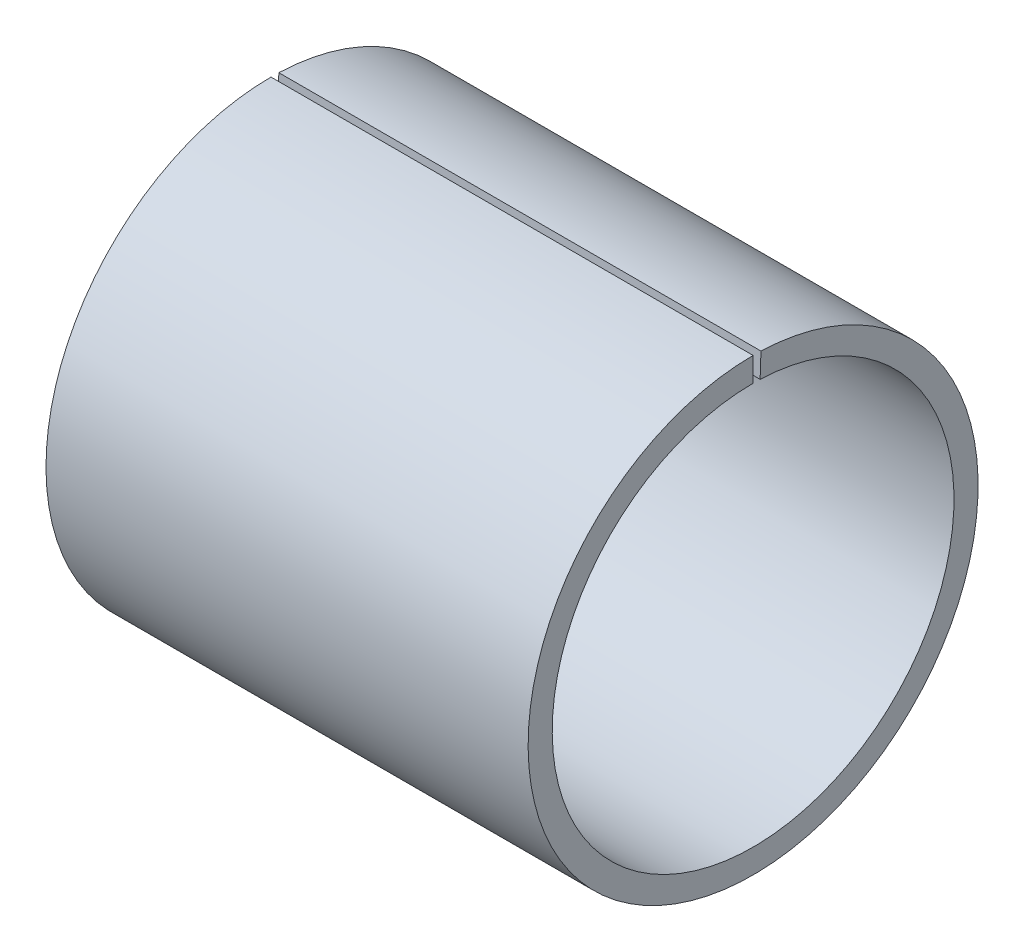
ISO-10303-21;
HEADER;
FILE_DESCRIPTION(('STEP AP214'),'2;1');
FILE_NAME('part.step','',(''),(''),'','','');
FILE_SCHEMA(('AUTOMOTIVE_DESIGN { 1 0 10303 214 1 1 1 1 }'));
ENDSEC;
DATA;
#1=APPLICATION_CONTEXT('core data for automotive mechanical design processes');
#2=APPLICATION_PROTOCOL_DEFINITION('international standard','automotive_design',2000,#1);
#3=PRODUCT_CONTEXT('',#1,'mechanical');
#4=PRODUCT('Part','Part','',(#3));
#5=PRODUCT_RELATED_PRODUCT_CATEGORY('part','',(#4));
#6=PRODUCT_DEFINITION_FORMATION('','',#4);
#7=PRODUCT_DEFINITION_CONTEXT('part definition',#1,'design');
#8=PRODUCT_DEFINITION('design','',#6,#7);
#9=PRODUCT_DEFINITION_SHAPE('','',#8);
#10=(LENGTH_UNIT() NAMED_UNIT(*) SI_UNIT(.MILLI.,.METRE.));
#11=(NAMED_UNIT(*) PLANE_ANGLE_UNIT() SI_UNIT($,.RADIAN.));
#12=(NAMED_UNIT(*) SI_UNIT($,.STERADIAN.) SOLID_ANGLE_UNIT());
#13=UNCERTAINTY_MEASURE_WITH_UNIT(LENGTH_MEASURE(1.E-05),#10,'distance_accuracy_value','');
#14=(GEOMETRIC_REPRESENTATION_CONTEXT(3) GLOBAL_UNCERTAINTY_ASSIGNED_CONTEXT((#13)) GLOBAL_UNIT_ASSIGNED_CONTEXT((#10,
#11,#12)) REPRESENTATION_CONTEXT('',''));
#15=CARTESIAN_POINT('',(0.,0.,0.));
#16=DIRECTION('',(0.,0.,1.));
#17=DIRECTION('',(1.,0.,0.));
#18=AXIS2_PLACEMENT_3D('',#15,#16,#17);
#19=CARTESIAN_POINT('',(0.,13.9914715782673,-0.488592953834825));
#20=DIRECTION('',(1.,0.,0.));
#21=DIRECTION('',(0.,0.,-1.));
#22=AXIS2_PLACEMENT_3D('',#19,#20,#21);
#23=PLANE('',#22);
#24=CARTESIAN_POINT('',(0.,0.,0.));
#25=DIRECTION('',(-1.,0.,0.));
#26=DIRECTION('',(0.,0.,1.));
#27=AXIS2_PLACEMENT_3D('',#24,#25,#26);
#28=CIRCLE('',#27,12.5);
#29=CARTESIAN_POINT('',(0.,12.4923853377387,-0.436243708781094));
#30=VERTEX_POINT('',#29);
#31=CARTESIAN_POINT('',(0.,12.5,0.));
#32=VERTEX_POINT('',#31);
#33=EDGE_CURVE('E11',#30,#32,#28,.T.);
#34=ORIENTED_EDGE('',*,*,#33,.F.);
#35=DIRECTION('',(0.,-0.999390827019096,0.0348994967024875));
#36=VECTOR('',#35,1.);
#37=CARTESIAN_POINT('',(0.,13.9914715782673,-0.488592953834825));
#38=LINE('',#37,#36);
#39=CARTESIAN_POINT('',(0.,13.9914715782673,-0.488592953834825));
#40=VERTEX_POINT('',#39);
#41=EDGE_CURVE('E88',#40,#30,#38,.T.);
#42=ORIENTED_EDGE('',*,*,#41,.F.);
#43=CARTESIAN_POINT('',(0.,0.,0.));
#44=DIRECTION('',(-1.,0.,0.));
#45=DIRECTION('',(0.,0.,1.));
#46=AXIS2_PLACEMENT_3D('',#43,#44,#45);
#47=CIRCLE('',#46,14.);
#48=CARTESIAN_POINT('',(0.,14.,0.));
#49=VERTEX_POINT('',#48);
#50=EDGE_CURVE('E41',#40,#49,#47,.T.);
#51=ORIENTED_EDGE('',*,*,#50,.T.);
#52=DIRECTION('',(0.,-1.,0.));
#53=VECTOR('',#52,1.);
#54=CARTESIAN_POINT('',(0.,14.,0.));
#55=LINE('',#54,#53);
#56=EDGE_CURVE('E77',#49,#32,#55,.T.);
#57=ORIENTED_EDGE('',*,*,#56,.T.);
#58=EDGE_LOOP('',(#34,#42,#51,#57));
#59=FACE_BOUND('',#58,.T.);
#60=ADVANCED_FACE('F26',(#59),#23,.F.);
#61=CARTESIAN_POINT('',(0.,0.,0.));
#62=DIRECTION('',(-1.,0.,0.));
#63=DIRECTION('',(0.,0.,1.));
#64=AXIS2_PLACEMENT_3D('',#61,#62,#63);
#65=CYLINDRICAL_SURFACE('',#64,12.5);
#66=CARTESIAN_POINT('',(30.,0.,0.));
#67=DIRECTION('',(-1.,0.,0.));
#68=DIRECTION('',(0.,0.,1.));
#69=AXIS2_PLACEMENT_3D('',#66,#67,#68);
#70=CIRCLE('',#69,12.5);
#71=CARTESIAN_POINT('',(30.,12.4923853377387,-0.436243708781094));
#72=VERTEX_POINT('',#71);
#73=CARTESIAN_POINT('',(30.,12.5,0.));
#74=VERTEX_POINT('',#73);
#75=EDGE_CURVE('E34',#72,#74,#70,.T.);
#76=ORIENTED_EDGE('',*,*,#75,.F.);
#77=DIRECTION('',(1.,0.,0.));
#78=VECTOR('',#77,1.);
#79=CARTESIAN_POINT('',(0.,12.4923853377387,-0.436243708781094));
#80=LINE('',#79,#78);
#81=EDGE_CURVE('E73',#30,#72,#80,.T.);
#82=ORIENTED_EDGE('',*,*,#81,.F.);
#83=ORIENTED_EDGE('',*,*,#33,.T.);
#84=DIRECTION('',(1.,0.,0.));
#85=VECTOR('',#84,1.);
#86=CARTESIAN_POINT('',(0.,12.5,0.));
#87=LINE('',#86,#85);
#88=EDGE_CURVE('E70',#32,#74,#87,.T.);
#89=ORIENTED_EDGE('',*,*,#88,.T.);
#90=EDGE_LOOP('',(#76,#82,#83,#89));
#91=FACE_BOUND('',#90,.T.);
#92=ADVANCED_FACE('F28',(#91),#65,.F.);
#93=CARTESIAN_POINT('',(30.,13.9914715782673,-0.488592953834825));
#94=DIRECTION('',(-1.,0.,0.));
#95=DIRECTION('',(0.,0.,1.));
#96=AXIS2_PLACEMENT_3D('',#93,#94,#95);
#97=PLANE('',#96);
#98=CARTESIAN_POINT('',(30.,0.,0.));
#99=DIRECTION('',(-1.,0.,0.));
#100=DIRECTION('',(0.,0.,1.));
#101=AXIS2_PLACEMENT_3D('',#98,#99,#100);
#102=CIRCLE('',#101,14.);
#103=CARTESIAN_POINT('',(30.,13.9914715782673,-0.488592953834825));
#104=VERTEX_POINT('',#103);
#105=CARTESIAN_POINT('',(30.,14.,0.));
#106=VERTEX_POINT('',#105);
#107=EDGE_CURVE('E49',#104,#106,#102,.T.);
#108=ORIENTED_EDGE('',*,*,#107,.F.);
#109=DIRECTION('',(0.,0.999390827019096,-0.0348994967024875));
#110=VECTOR('',#109,1.);
#111=CARTESIAN_POINT('',(30.,13.9914715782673,-0.488592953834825));
#112=LINE('',#111,#110);
#113=EDGE_CURVE('E91',#72,#104,#112,.T.);
#114=ORIENTED_EDGE('',*,*,#113,.F.);
#115=ORIENTED_EDGE('',*,*,#75,.T.);
#116=DIRECTION('',(0.,1.,0.));
#117=VECTOR('',#116,1.);
#118=CARTESIAN_POINT('',(30.,14.,0.));
#119=LINE('',#118,#117);
#120=EDGE_CURVE('E82',#74,#106,#119,.T.);
#121=ORIENTED_EDGE('',*,*,#120,.T.);
#122=EDGE_LOOP('',(#108,#114,#115,#121));
#123=FACE_BOUND('',#122,.T.);
#124=ADVANCED_FACE('F97',(#123),#97,.F.);
#125=CARTESIAN_POINT('',(0.,0.,0.));
#126=DIRECTION('',(-1.,0.,0.));
#127=DIRECTION('',(0.,0.,1.));
#128=AXIS2_PLACEMENT_3D('',#125,#126,#127);
#129=CYLINDRICAL_SURFACE('',#128,14.);
#130=DIRECTION('',(-1.,0.,0.));
#131=VECTOR('',#130,1.);
#132=CARTESIAN_POINT('',(0.,13.9914715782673,-0.488592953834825));
#133=LINE('',#132,#131);
#134=EDGE_CURVE('E93',#104,#40,#133,.T.);
#135=ORIENTED_EDGE('',*,*,#134,.F.);
#136=ORIENTED_EDGE('',*,*,#107,.T.);
#137=DIRECTION('',(-1.,0.,0.));
#138=VECTOR('',#137,1.);
#139=CARTESIAN_POINT('',(0.,14.,0.));
#140=LINE('',#139,#138);
#141=EDGE_CURVE('E84',#106,#49,#140,.T.);
#142=ORIENTED_EDGE('',*,*,#141,.T.);
#143=ORIENTED_EDGE('',*,*,#50,.F.);
#144=EDGE_LOOP('',(#135,#136,#142,#143));
#145=FACE_BOUND('',#144,.T.);
#146=ADVANCED_FACE('F100',(#145),#129,.T.);
#147=CARTESIAN_POINT('',(0.,12.4923853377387,-0.436243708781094));
#148=DIRECTION('',(0.,0.0348994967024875,0.999390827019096));
#149=DIRECTION('',(1.,0.,0.));
#150=AXIS2_PLACEMENT_3D('',#147,#148,#149);
#151=PLANE('',#150);
#152=ORIENTED_EDGE('',*,*,#41,.T.);
#153=ORIENTED_EDGE('',*,*,#81,.T.);
#154=ORIENTED_EDGE('',*,*,#113,.T.);
#155=ORIENTED_EDGE('',*,*,#134,.T.);
#156=EDGE_LOOP('',(#152,#153,#154,#155));
#157=FACE_BOUND('',#156,.T.);
#158=ADVANCED_FACE('F99',(#157),#151,.T.);
#159=CARTESIAN_POINT('',(0.,12.5,0.));
#160=DIRECTION('',(0.,0.,1.));
#161=DIRECTION('',(1.,0.,0.));
#162=AXIS2_PLACEMENT_3D('',#159,#160,#161);
#163=PLANE('',#162);
#164=ORIENTED_EDGE('',*,*,#56,.F.);
#165=ORIENTED_EDGE('',*,*,#141,.F.);
#166=ORIENTED_EDGE('',*,*,#120,.F.);
#167=ORIENTED_EDGE('',*,*,#88,.F.);
#168=EDGE_LOOP('',(#164,#165,#166,#167));
#169=FACE_BOUND('',#168,.T.);
#170=ADVANCED_FACE('F81',(#169),#163,.F.);
#171=CLOSED_SHELL('',(#60,#92,#124,#146,#158,#170));
#172=MANIFOLD_SOLID_BREP('B2',#171);
#173=ADVANCED_BREP_SHAPE_REPRESENTATION('',(#18,#172),#14);
#174=SHAPE_DEFINITION_REPRESENTATION(#9,#173);
ENDSEC;
END-ISO-10303-21;
